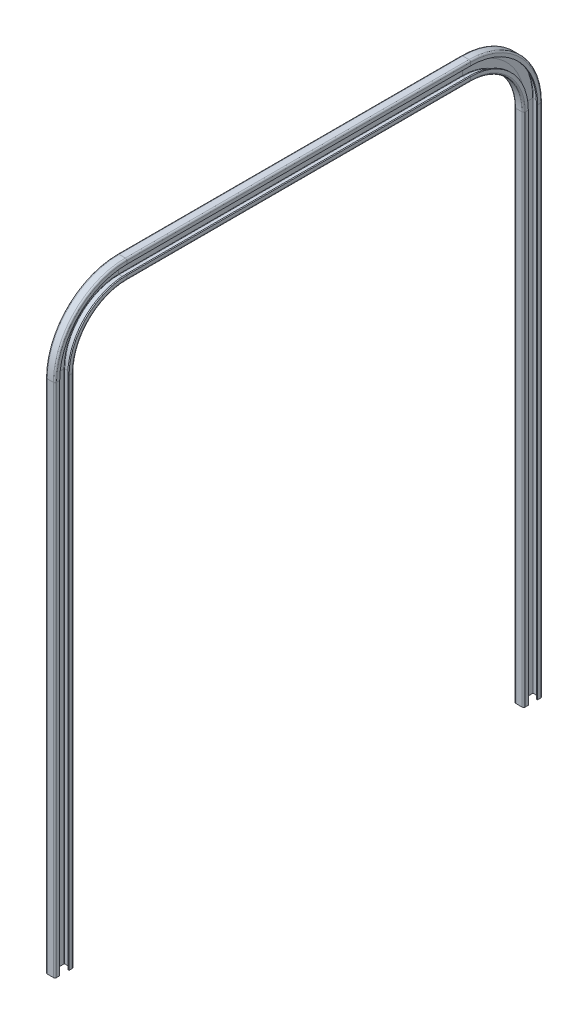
from build123d import *


with BuildPart() as part:
    # Austragung1: sweep along a path in Skizze2
    with BuildLine(Plane(origin=(0, 0, 0), x_dir=(0, 0, -1), z_dir=(1, 0, 0))) as austragung1_path:
        Line((0, 0), (0, 1650))
        ThreePointArc((0, 1650), (58.578643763, 1791.421356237), (200, 1850))
        Line((200, 1850), (1300, 1850))
        ThreePointArc((1300, 1850), (1441.421356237, 1791.421356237), (1500, 1650))
        Line((1500, 1650), (1500, 0))
    # Skizze1 → Austragung1 (sweep)
    with BuildSketch(Plane(origin=(0, 0, 0), x_dir=(1, 0, 0), z_dir=(0, 1, 0))):
        with BuildLine():
            Line((0, 0), (0, -25))
            ThreePointArc((0, -25), (1.464466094, -28.535533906), (5, -30))
            Line((5, -30), (25, -30))
            ThreePointArc((25, -30), (28.535533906, -28.535533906), (30, -25))
            Line((30, -25), (30, -15))
            Line((30, -15), (26, -15))
            Line((26, -15), (26, -25))
            ThreePointArc((26, -25), (25.707106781, -25.707106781), (25, -26))
            Line((25, -26), (5, -26))
            ThreePointArc((5, -26), (4.292893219, -25.707106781), (4, -25))
            Line((4, -25), (4, 0))
            Line((4, 0), (4, 25))
            ThreePointArc((4, 25), (4.292893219, 25.707106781), (5, 26))
            Line((5, 26), (25, 26))
            ThreePointArc((25, 26), (25.707106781, 25.707106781), (26, 25))
            Line((26, 25), (26, 15))
            Line((26, 15), (30, 15))
            Line((30, 15), (30, 25))
            ThreePointArc((30, 25), (28.535533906, 28.535533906), (25, 30))
            Line((25, 30), (5, 30))
            ThreePointArc((5, 30), (1.464466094, 28.535533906), (0, 25))
            Line((0, 25), (0, 0))
        make_face()
    sweep(path=austragung1_path.line)


solid = part.part
